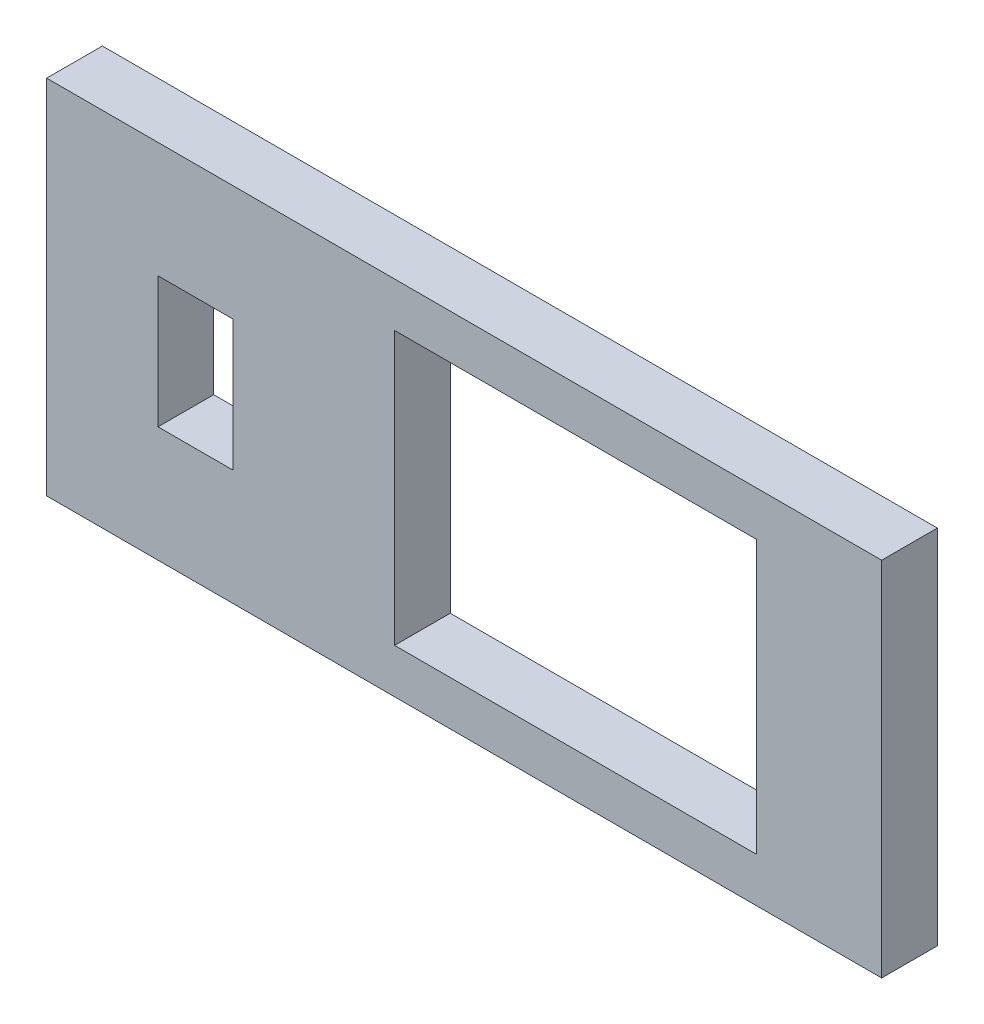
from build123d import *

# Parameters (mm, degrees)
SKIZZE1_W                       = 300
SKIZZE1_H                       = 20
AUFSATZ_LINEAR_AUSTRAGEN1_DEPTH = 130
SKIZZE2_W                       = 27
SKIZZE2_H                       = 47
SCHNITT_LINEAR_AUSTRAGEN1_DEPTH = 20
SKIZZE3_W                       = 130
SKIZZE3_H                       = 98
SCHNITT_LINEAR_AUSTRAGEN2_DEPTH = 20


with BuildPart() as part:
    # Skizze1 → Aufsatz-Linear austragen1 (new body)
    with BuildSketch(Plane(origin=(0, 0, 0), x_dir=(1, 0, 0), z_dir=(0, 1, 0))):
        with Locations((-150, -10)):
            Rectangle(SKIZZE1_W, SKIZZE1_H)
    extrude(amount=AUFSATZ_LINEAR_AUSTRAGEN1_DEPTH)

    # Skizze2 → Schnitt-Linear austragen1 (cut)
    with BuildSketch(Plane.XY.offset(20)):
        with Locations((-246.5, 65)):
            Rectangle(SKIZZE2_W, SKIZZE2_H)
    extrude(amount=-SCHNITT_LINEAR_AUSTRAGEN1_DEPTH, mode=Mode.SUBTRACT)

    # Skizze3 → Schnitt-Linear austragen2 (cut)
    with BuildSketch(Plane.XY.offset(20)):
        with Locations((-110, 65)):
            Rectangle(SKIZZE3_W, SKIZZE3_H)
    extrude(amount=-SCHNITT_LINEAR_AUSTRAGEN2_DEPTH, mode=Mode.SUBTRACT)


solid = part.part
